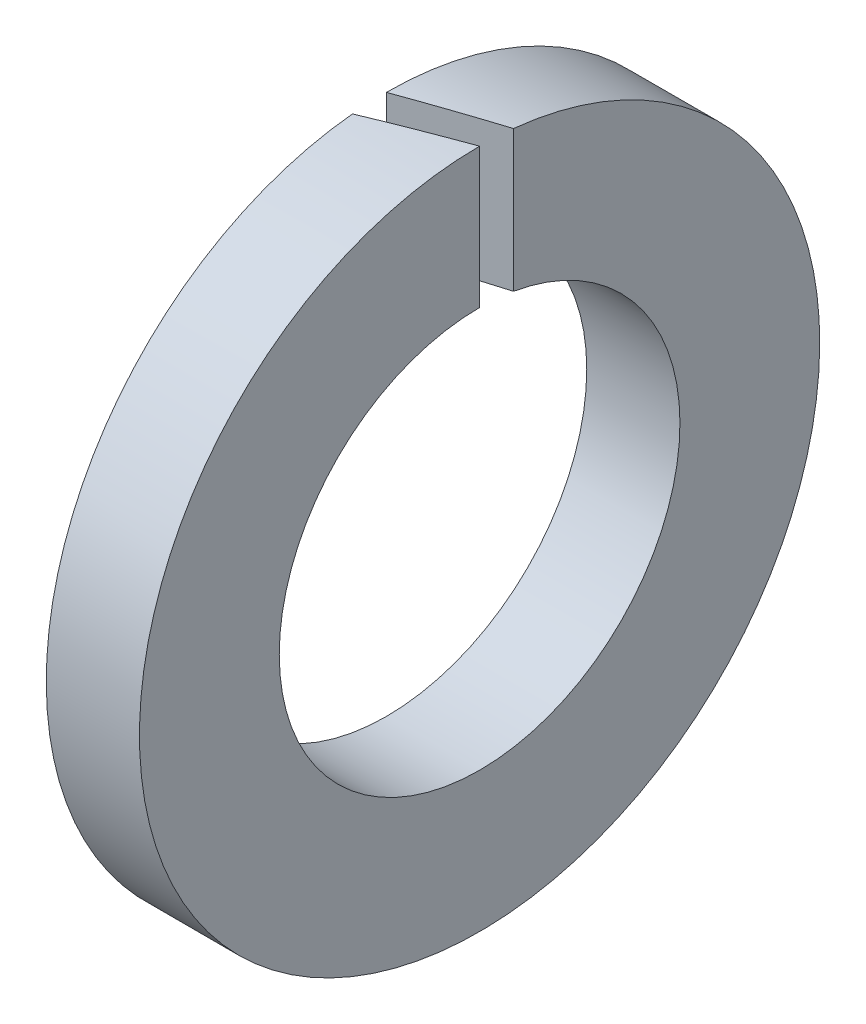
from build123d import *

# Parameters (mm, degrees)
ESQUISSE1_W             = 1
ESQUISSE1_H             = 1.5
ENL_V_MAT_EXTRU_1_DEPTH = 6.257851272


with BuildPart() as part:
    # Esquisse1 → Base-R_volution (revolve)
    with BuildSketch(Plane(origin=(0, 0, 0), x_dir=(1, 0, 0), z_dir=(0, 1, 0)), mode=Mode.PRIVATE) as base_r_volution_sk:
        with Locations((0.5, 2.9)):
            Rectangle(ESQUISSE1_W, ESQUISSE1_H)
    revolve(base_r_volution_sk.sketch.rotate(Axis((0, 0, 0), (1, 0, 0)), 180), axis=Axis((0, 0, 0), (1, 0, 0)))

    # Esquisse2 → Enl_v. mat.-Extru.1 (cut, through all)
    with BuildSketch(Plane(origin=(0, 0, 0), x_dir=(1, 0, 0), z_dir=(0, 1, 0))):
        Polygon((0, 0), (1, 0.363970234), (1, 0), (0, -0.363970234), align=None)
    extrude(amount=ENL_V_MAT_EXTRU_1_DEPTH, mode=Mode.SUBTRACT)


solid = part.part
